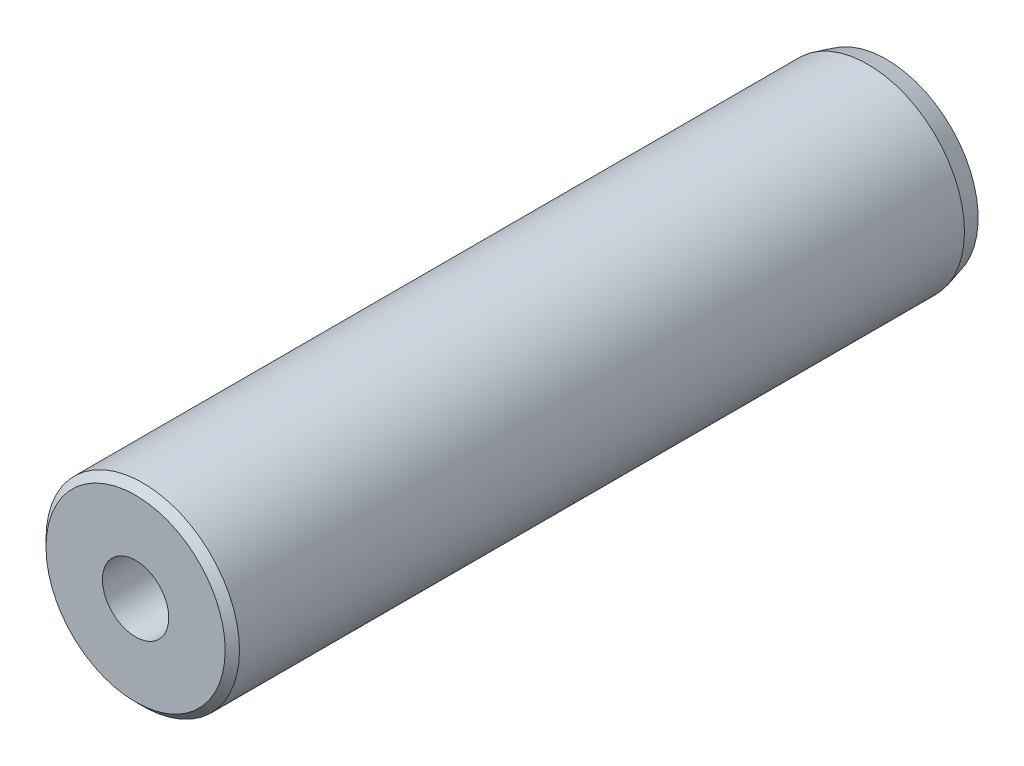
ISO-10303-21;
HEADER;
FILE_DESCRIPTION(('STEP AP214'),'2;1');
FILE_NAME('part.step','',(''),(''),'','','');
FILE_SCHEMA(('AUTOMOTIVE_DESIGN { 1 0 10303 214 1 1 1 1 }'));
ENDSEC;
DATA;
#1=APPLICATION_CONTEXT('core data for automotive mechanical design processes');
#2=APPLICATION_PROTOCOL_DEFINITION('international standard','automotive_design',2000,#1);
#3=PRODUCT_CONTEXT('',#1,'mechanical');
#4=PRODUCT('Part','Part','',(#3));
#5=PRODUCT_RELATED_PRODUCT_CATEGORY('part','',(#4));
#6=PRODUCT_DEFINITION_FORMATION('','',#4);
#7=PRODUCT_DEFINITION_CONTEXT('part definition',#1,'design');
#8=PRODUCT_DEFINITION('design','',#6,#7);
#9=PRODUCT_DEFINITION_SHAPE('','',#8);
#10=(LENGTH_UNIT() NAMED_UNIT(*) SI_UNIT(.MILLI.,.METRE.));
#11=(NAMED_UNIT(*) PLANE_ANGLE_UNIT() SI_UNIT($,.RADIAN.));
#12=(NAMED_UNIT(*) SI_UNIT($,.STERADIAN.) SOLID_ANGLE_UNIT());
#13=UNCERTAINTY_MEASURE_WITH_UNIT(LENGTH_MEASURE(1.E-05),#10,'distance_accuracy_value','');
#14=(GEOMETRIC_REPRESENTATION_CONTEXT(3) GLOBAL_UNCERTAINTY_ASSIGNED_CONTEXT((#13)) GLOBAL_UNIT_ASSIGNED_CONTEXT((#10,
#11,#12)) REPRESENTATION_CONTEXT('',''));
#15=CARTESIAN_POINT('',(0.,0.,0.));
#16=DIRECTION('',(0.,0.,1.));
#17=DIRECTION('',(1.,0.,0.));
#18=AXIS2_PLACEMENT_3D('',#15,#16,#17);
#19=CARTESIAN_POINT('',(0.,0.,-41.5372037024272));
#20=DIRECTION('',(0.,0.,-1.));
#21=DIRECTION('',(-1.,0.,0.));
#22=AXIS2_PLACEMENT_3D('',#19,#20,#21);
#23=CYLINDRICAL_SURFACE('',#22,3.2639);
#24=CARTESIAN_POINT('',(0.,0.,38.1));
#25=DIRECTION('',(0.,0.,-1.));
#26=DIRECTION('',(-1.,0.,0.));
#27=AXIS2_PLACEMENT_3D('',#24,#25,#26);
#28=CIRCLE('',#27,3.2639);
#29=CARTESIAN_POINT('',(-3.26390000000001,0.,38.1));
#30=VERTEX_POINT('',#29);
#31=EDGE_CURVE('E11',#30,#30,#28,.T.);
#32=ORIENTED_EDGE('',*,*,#31,.F.);
#33=EDGE_LOOP('',(#32));
#34=FACE_BOUND('',#33,.T.);
#35=CARTESIAN_POINT('',(0.,0.,28.09875));
#36=DIRECTION('',(0.,0.,-1.));
#37=DIRECTION('',(-1.,0.,0.));
#38=AXIS2_PLACEMENT_3D('',#35,#36,#37);
#39=CIRCLE('',#38,3.2639);
#40=CARTESIAN_POINT('',(-3.26390000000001,0.,28.09875));
#41=VERTEX_POINT('',#40);
#42=EDGE_CURVE('E84',#41,#41,#39,.T.);
#43=ORIENTED_EDGE('',*,*,#42,.T.);
#44=EDGE_LOOP('',(#43));
#45=FACE_BOUND('',#44,.T.);
#46=ADVANCED_FACE('F51',(#34,#45),#23,.F.);
#47=CARTESIAN_POINT('',(-3.26390000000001,0.,38.1));
#48=DIRECTION('',(0.,0.,-1.));
#49=DIRECTION('',(-1.,0.,0.));
#50=AXIS2_PLACEMENT_3D('',#47,#48,#49);
#51=PLANE('',#50);
#52=CARTESIAN_POINT('',(0.,0.,38.1));
#53=DIRECTION('',(0.,0.,-1.));
#54=DIRECTION('',(-1.,0.,0.));
#55=AXIS2_PLACEMENT_3D('',#52,#53,#54);
#56=CIRCLE('',#55,8.82015);
#57=CARTESIAN_POINT('',(-8.82015000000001,0.,38.1));
#58=VERTEX_POINT('',#57);
#59=EDGE_CURVE('E58',#58,#58,#56,.T.);
#60=ORIENTED_EDGE('',*,*,#59,.F.);
#61=EDGE_LOOP('',(#60));
#62=FACE_BOUND('',#61,.T.);
#63=ORIENTED_EDGE('',*,*,#31,.T.);
#64=EDGE_LOOP('',(#63));
#65=FACE_BOUND('',#64,.T.);
#66=ADVANCED_FACE('F74',(#62,#65),#51,.F.);
#67=CARTESIAN_POINT('',(0.,0.,38.1));
#68=DIRECTION('',(0.,0.,-1.));
#69=DIRECTION('',(-1.,0.,0.));
#70=AXIS2_PLACEMENT_3D('',#67,#68,#69);
#71=CONICAL_SURFACE('',#70,8.82015,0.785398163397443);
#72=CARTESIAN_POINT('',(0.,0.,37.39515));
#73=DIRECTION('',(0.,0.,-1.));
#74=DIRECTION('',(-1.,0.,0.));
#75=AXIS2_PLACEMENT_3D('',#72,#73,#74);
#76=CIRCLE('',#75,9.525);
#77=CARTESIAN_POINT('',(-9.52500000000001,0.,37.39515));
#78=VERTEX_POINT('',#77);
#79=EDGE_CURVE('E97',#78,#78,#76,.T.);
#80=ORIENTED_EDGE('',*,*,#79,.F.);
#81=EDGE_LOOP('',(#80));
#82=FACE_BOUND('',#81,.T.);
#83=ORIENTED_EDGE('',*,*,#59,.T.);
#84=EDGE_LOOP('',(#83));
#85=FACE_BOUND('',#84,.T.);
#86=ADVANCED_FACE('F79',(#82,#85),#71,.T.);
#87=CARTESIAN_POINT('',(0.,0.,-41.5372037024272));
#88=DIRECTION('',(0.,0.,-1.));
#89=DIRECTION('',(-1.,0.,0.));
#90=AXIS2_PLACEMENT_3D('',#87,#88,#89);
#91=CYLINDRICAL_SURFACE('',#90,9.52500000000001);
#92=CARTESIAN_POINT('',(0.,0.,-33.9826983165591));
#93=DIRECTION('',(0.,0.,-1.));
#94=DIRECTION('',(-1.,0.,0.));
#95=AXIS2_PLACEMENT_3D('',#92,#93,#94);
#96=CIRCLE('',#95,9.52500000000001);
#97=CARTESIAN_POINT('',(-9.525,0.,-33.9826983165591));
#98=VERTEX_POINT('',#97);
#99=EDGE_CURVE('E91',#98,#98,#96,.T.);
#100=ORIENTED_EDGE('',*,*,#99,.F.);
#101=EDGE_LOOP('',(#100));
#102=FACE_BOUND('',#101,.T.);
#103=ORIENTED_EDGE('',*,*,#79,.T.);
#104=EDGE_LOOP('',(#103));
#105=FACE_BOUND('',#104,.T.);
#106=ADVANCED_FACE('F107',(#102,#105),#91,.T.);
#107=CARTESIAN_POINT('',(0.,0.,-33.9826983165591));
#108=DIRECTION('',(0.,0.,1.));
#109=DIRECTION('',(1.,0.,0.));
#110=AXIS2_PLACEMENT_3D('',#107,#108,#109);
#111=CONICAL_SURFACE('',#110,9.52500000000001,0.261799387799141);
#112=CARTESIAN_POINT('',(0.,0.,-35.8227870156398));
#113=DIRECTION('',(0.,0.,-1.));
#114=DIRECTION('',(-1.,0.,0.));
#115=AXIS2_PLACEMENT_3D('',#112,#113,#114);
#116=CIRCLE('',#115,9.03194971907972);
#117=CARTESIAN_POINT('',(-9.03194971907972,0.,-35.8227870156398));
#118=VERTEX_POINT('',#117);
#119=EDGE_CURVE('E86',#118,#118,#116,.T.);
#120=ORIENTED_EDGE('',*,*,#119,.F.);
#121=EDGE_LOOP('',(#120));
#122=FACE_BOUND('',#121,.T.);
#123=ORIENTED_EDGE('',*,*,#99,.T.);
#124=EDGE_LOOP('',(#123));
#125=FACE_BOUND('',#124,.T.);
#126=ADVANCED_FACE('F69',(#122,#125),#111,.T.);
#127=CARTESIAN_POINT('',(0.,0.,-19.05));
#128=DIRECTION('',(0.,0.,-1.));
#129=DIRECTION('',(-1.,0.,0.));
#130=AXIS2_PLACEMENT_3D('',#127,#128,#129);
#131=SPHERICAL_SURFACE('',#130,19.05);
#132=ORIENTED_EDGE('',*,*,#119,.T.);
#133=EDGE_LOOP('',(#132));
#134=FACE_BOUND('',#133,.T.);
#135=ADVANCED_FACE('F63',(#134),#131,.T.);
#136=CARTESIAN_POINT('',(0.,0.,26.214336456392));
#137=DIRECTION('',(0.,0.,1.));
#138=DIRECTION('',(1.,0.,0.));
#139=AXIS2_PLACEMENT_3D('',#136,#137,#138);
#140=CONICAL_SURFACE('',#139,0.,1.0471975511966);
#141=ORIENTED_EDGE('',*,*,#42,.F.);
#142=EDGE_LOOP('',(#141));
#143=FACE_BOUND('',#142,.T.);
#144=CARTESIAN_POINT('',(0.,0.,26.214336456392));
#145=VERTEX_POINT('',#144);
#146=VERTEX_LOOP('',#145);
#147=FACE_BOUND('',#146,.T.);
#148=ADVANCED_FACE('F61',(#143,#147),#140,.F.);
#149=CLOSED_SHELL('',(#46,#66,#86,#106,#126,#135,#148));
#150=MANIFOLD_SOLID_BREP('B2',#149);
#151=ADVANCED_BREP_SHAPE_REPRESENTATION('',(#18,#150),#14);
#152=SHAPE_DEFINITION_REPRESENTATION(#9,#151);
ENDSEC;
END-ISO-10303-21;
